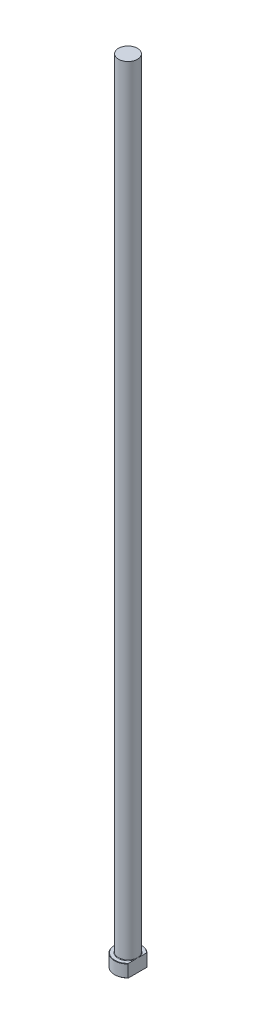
from build123d import *
from build123d.topology import SkipClean

# Parameters (mm, degrees)
CHAMFER1_SIZE    = 0.2
FILLET1_R        = 0.3
KEYED_HEAD_DEPTH = 501.144479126


with BuildPart() as part:
    # Sketch1 → Revolve1 (revolve)
    with BuildSketch(Plane.XY, mode=Mode.PRIVATE) as revolve1_sk:
        Polygon((0, 0), (-8.5, 0), (-8.5, 8), (-6, 8), (-6, 500), (0, 500), align=None)
    revolve(revolve1_sk.sketch.rotate(Axis((0, 259.958771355, 0), (0, -1, 0)), 270), axis=Axis((0, 259.958771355, 0), (0, -1, 0)))

    # Chamfer1
    chamfer1_edges = [part.edges().sort_by_distance(p)[0] for p in [
        (0, 8, -8.5),
        (0, 0, -8.5),
    ]]
    chamfer(chamfer1_edges, length=CHAMFER1_SIZE)

    # Fillet1
    fillet1_edges = [part.edges().sort_by_distance(p)[0] for p in [
        (0, 8, -6),
    ]]
    fillet(fillet1_edges, radius=FILLET1_R)

    # Sketch2 → KEYED HEAD (cut, through all)
    with SkipClean():  # the faces are left unmerged after this step: merging them gives an invalid solid
        with BuildSketch(Plane(origin=(0, 0, 0), x_dir=(1, 0, 0), z_dir=(0, 1, 0))):
            with BuildLine():
                Line((6, -6.020797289), (6, 6.020797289))
                ThreePointArc((6, 6.020797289), (8.5, 0), (6, -6.020797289))
            make_face()
        extrude(amount=KEYED_HEAD_DEPTH, mode=Mode.SUBTRACT)


solid = part.part
